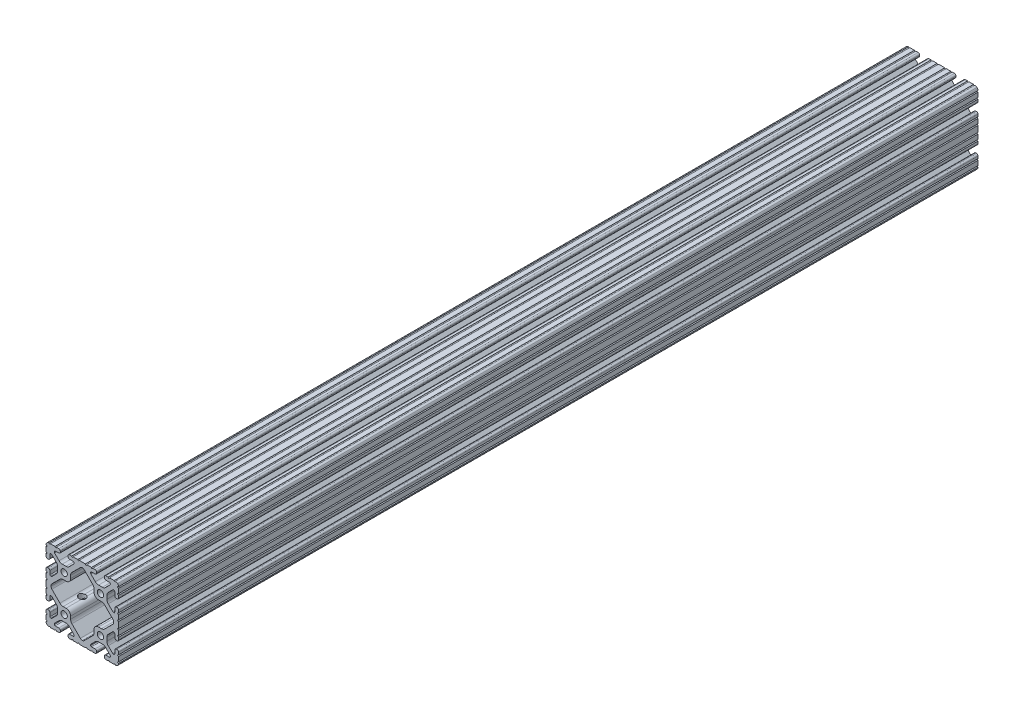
from build123d import *

# Parameters (mm, degrees)
SKETCH1_R      = 3.3274
EXTRUDE2_DEPTH = 901.7
SKETCH2_R      = 3.571875
EXTRUDE8_DEPTH = 76.2


with BuildPart() as part:
    # Sketch1 → Extrude2 (new body)
    with BuildSketch(Plane.XY):
        with BuildLine():
            Line((225.342686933, 144.720000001), (220.514725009, 144.720000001))
            ThreePointArc((220.514725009, 144.720000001), (219.752928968, 143.940370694), (218.991132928, 144.720000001))
            Line((218.991132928, 144.720000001), (216.708800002, 144.720000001))
            ThreePointArc((216.708800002, 144.720000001), (215.595248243, 144.25875176), (215.134000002, 143.145200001))
            Line((215.134000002, 143.145200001), (215.134000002, 142.230800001))
            ThreePointArc((215.134000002, 142.230800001), (215.595248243, 141.117248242), (216.708800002, 140.656000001))
            Line((216.708800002, 140.656000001), (220.468000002, 140.656000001))
            ThreePointArc((220.468000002, 140.656000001), (221.096617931, 140.395617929), (221.357000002, 139.767000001))
            Line((221.357000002, 139.767000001), (221.357000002, 139.113548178))
            ThreePointArc((221.357000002, 139.113548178), (221.289329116, 138.773343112), (221.096618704, 138.484931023))
            Line((221.096618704, 138.484931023), (216.4292875, 133.817588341))
            ThreePointArc((216.4292875, 133.817588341), (214.888340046, 132.787958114), (213.070667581, 132.4264))
            Line((213.070667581, 132.4264), (209.069332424, 132.4264))
            ThreePointArc((209.069332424, 132.4264), (207.251659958, 132.787958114), (205.710712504, 133.817588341))
            Line((205.710712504, 133.817588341), (201.019768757, 138.508543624))
            ThreePointArc((201.019768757, 138.508543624), (200.793324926, 138.893872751), (200.783000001, 139.340693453))
            Line((200.783000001, 139.340693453), (200.783000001, 139.767))
            ThreePointArc((200.783000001, 139.767), (201.043382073, 140.395617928), (201.672000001, 140.656))
            Line((201.672000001, 140.656), (205.431200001, 140.656))
            ThreePointArc((205.431200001, 140.656), (206.54475176, 141.117248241), (207.006000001, 142.2308))
            Line((207.006000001, 142.2308), (207.006000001, 143.1452))
            ThreePointArc((207.006000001, 143.1452), (206.54475176, 144.258751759), (205.431200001, 144.72))
            Line((205.431200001, 144.72), (203.042788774, 144.72))
            ThreePointArc((203.042788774, 144.72), (202.28084142, 143.940219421), (201.518894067, 144.72))
            Line((201.518894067, 144.72), (196.691221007, 144.72))
            ThreePointArc((196.691221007, 144.72), (195.929269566, 143.940215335), (195.167318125, 144.72))
            ThreePointArc((195.167318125, 144.72), (194.013713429, 144.463374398), (193.033876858, 143.802631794))
            ThreePointArc((193.033876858, 143.802631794), (192.282242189, 142.740195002), (192.020000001, 141.465457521))
            ThreePointArc((192.020000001, 141.465457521), (192.97852738, 140.729236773), (192.020000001, 139.993016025))
            Line((192.020000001, 139.993016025), (192.020000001, 135.165258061))
            ThreePointArc((192.020000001, 135.165258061), (193.002219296, 134.404542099), (192.020000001, 133.643826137))
            Line((192.020000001, 133.643826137), (192.020000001, 131.250195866))
            ThreePointArc((192.020000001, 131.250195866), (192.481248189, 130.136644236), (193.594799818, 129.675396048))
            Line((193.594799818, 129.675396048), (194.509200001, 129.675396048))
            ThreePointArc((194.509200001, 129.675396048), (195.62275176, 130.136644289), (196.084000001, 131.250196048))
            Line((196.084000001, 131.250196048), (196.084000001, 135.068))
            ThreePointArc((196.084000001, 135.068), (196.344382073, 135.696617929), (196.973000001, 135.957))
            Line((196.973000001, 135.957), (197.455712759, 135.957))
            ThreePointArc((197.455712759, 135.957), (197.795918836, 135.889328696), (198.084331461, 135.696617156))
            Line((198.084331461, 135.696617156), (202.922419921, 130.858516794))
            ThreePointArc((202.922419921, 130.858516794), (203.952044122, 129.317572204), (204.3136, 127.499905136))
            Line((204.3136, 127.499905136), (204.3136, 123.840094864))
            ThreePointArc((204.3136, 123.840094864), (203.952044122, 122.022427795), (202.92241992, 120.481483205))
            Line((202.92241992, 120.481483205), (198.171055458, 115.730107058))
            ThreePointArc((198.171055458, 115.730107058), (197.786582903, 115.473210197), (197.333066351, 115.383000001))
            Line((197.333066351, 115.383000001), (197.059724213, 115.383000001))
            ThreePointArc((197.059724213, 115.383000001), (196.369783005, 115.668783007), (196.084, 116.358724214))
            Line((196.084, 116.358724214), (196.084, 120.089803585))
            ThreePointArc((196.084, 120.089803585), (195.622751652, 121.203355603), (194.509199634, 121.664603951))
            Line((194.509199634, 121.664603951), (193.5948, 121.664603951))
            ThreePointArc((193.5948, 121.664603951), (192.481248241, 121.20335571), (192.02, 120.089803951))
            Line((192.02, 120.089803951), (192.02, 117.695039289))
            ThreePointArc((192.02, 117.695039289), (193.002999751, 116.933517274), (192.02, 116.171995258))
            Line((192.02, 116.171995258), (192.02, 111.343759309))
            ThreePointArc((192.02, 111.343759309), (193.002999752, 110.582237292), (192.020000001, 109.820715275))
            Line((192.020000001, 109.820715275), (192.020000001, 103.419284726))
            ThreePointArc((192.020000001, 103.419284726), (193.002999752, 102.65776271), (192.020000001, 101.896240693))
            Line((192.020000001, 101.896240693), (192.020000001, 97.068004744))
            ThreePointArc((192.020000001, 97.068004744), (193.002999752, 96.306482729), (192.020000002, 95.544960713))
            Line((192.020000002, 95.544960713), (192.020000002, 93.150196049))
            ThreePointArc((192.020000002, 93.150196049), (192.481248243, 92.03664429), (193.594800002, 91.575396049))
            Line((193.594800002, 91.575396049), (194.509199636, 91.575396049))
            ThreePointArc((194.509199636, 91.575396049), (195.622751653, 92.036644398), (196.084000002, 93.150196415))
            Line((196.084000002, 93.150196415), (196.084000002, 96.881275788))
            ThreePointArc((196.084000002, 96.881275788), (196.369783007, 97.571216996), (197.059724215, 97.857000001))
            Line((197.059724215, 97.857000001), (197.333066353, 97.857000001))
            ThreePointArc((197.333066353, 97.857000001), (197.786582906, 97.766789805), (198.171055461, 97.509892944))
            Line((198.171055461, 97.509892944), (202.922419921, 92.758516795))
            ThreePointArc((202.922419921, 92.758516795), (203.952044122, 91.217572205), (204.313600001, 89.399905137))
            Line((204.313600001, 89.399905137), (204.313600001, 85.740094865))
            ThreePointArc((204.313600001, 85.740094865), (203.952044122, 83.922427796), (202.92241992, 82.381483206))
            Line((202.92241992, 82.381483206), (198.084331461, 77.543382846))
            ThreePointArc((198.084331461, 77.543382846), (197.795918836, 77.350671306), (197.455712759, 77.283000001))
            Line((197.455712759, 77.283000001), (196.973000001, 77.283000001))
            ThreePointArc((196.973000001, 77.283000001), (196.344382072, 77.543382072), (196.084000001, 78.172000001))
            Line((196.084000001, 78.172000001), (196.084000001, 81.98980395))
            ThreePointArc((196.084000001, 81.98980395), (195.62275176, 83.103355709), (194.509200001, 83.56460395))
            Line((194.509200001, 83.56460395), (193.594799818, 83.56460395))
            ThreePointArc((193.594799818, 83.56460395), (192.481248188, 83.103355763), (192.020000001, 81.989804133))
            Line((192.020000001, 81.989804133), (192.020000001, 79.596173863))
            ThreePointArc((192.020000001, 79.596173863), (193.002219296, 78.835457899), (192.020000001, 78.074741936))
            Line((192.020000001, 78.074741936), (192.020000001, 73.246983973))
            ThreePointArc((192.020000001, 73.246983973), (192.97852738, 72.510763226), (192.020000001, 71.774542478))
            ThreePointArc((192.020000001, 71.774542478), (192.282242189, 70.499804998), (193.033876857, 69.437368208))
            ThreePointArc((193.033876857, 69.437368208), (194.013713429, 68.776625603), (195.167318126, 68.520000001))
            ThreePointArc((195.167318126, 68.520000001), (195.929269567, 69.299784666), (196.691221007, 68.520000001))
            Line((196.691221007, 68.520000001), (201.518894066, 68.520000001))
            ThreePointArc((201.518894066, 68.520000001), (202.280841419, 69.29978058), (203.042788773, 68.520000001))
            Line((203.042788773, 68.520000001), (205.431200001, 68.520000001))
            ThreePointArc((205.431200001, 68.520000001), (206.54475176, 68.981248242), (207.006000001, 70.094800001))
            Line((207.006000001, 70.094800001), (207.006000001, 71.009200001))
            ThreePointArc((207.006000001, 71.009200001), (206.54475176, 72.12275176), (205.431200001, 72.584000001))
            Line((205.431200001, 72.584000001), (201.672000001, 72.584000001))
            ThreePointArc((201.672000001, 72.584000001), (201.043382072, 72.844382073), (200.783000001, 73.473000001))
            Line((200.783000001, 73.473000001), (200.783000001, 73.899306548))
            ThreePointArc((200.783000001, 73.899306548), (200.793324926, 74.346127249), (201.019768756, 74.731456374))
            Line((201.019768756, 74.731456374), (205.710712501, 79.422411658))
            ThreePointArc((205.710712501, 79.422411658), (207.251659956, 80.452041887), (209.069332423, 80.813600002))
            Line((209.069332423, 80.813600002), (213.07066758, 80.813600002))
            ThreePointArc((213.07066758, 80.813600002), (214.888340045, 80.452041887), (216.4292875, 79.42241166))
            Line((216.4292875, 79.42241166), (221.096618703, 74.755068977))
            ThreePointArc((221.096618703, 74.755068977), (221.289329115, 74.466656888), (221.357000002, 74.126451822))
            Line((221.357000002, 74.126451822), (221.357000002, 73.473000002))
            ThreePointArc((221.357000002, 73.473000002), (221.09661793, 72.844382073), (220.468000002, 72.584000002))
            Line((220.468000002, 72.584000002), (216.708800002, 72.584000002))
            ThreePointArc((216.708800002, 72.584000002), (215.595248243, 72.122751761), (215.134000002, 71.009200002))
            Line((215.134000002, 71.009200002), (215.134000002, 70.094800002))
            ThreePointArc((215.134000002, 70.094800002), (215.595248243, 68.981248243), (216.708800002, 68.520000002))
            Line((216.708800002, 68.520000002), (218.991132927, 68.520000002))
            ThreePointArc((218.991132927, 68.520000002), (219.752928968, 69.299629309), (220.514725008, 68.520000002))
            Line((220.514725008, 68.520000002), (225.342686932, 68.520000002))
            ThreePointArc((225.342686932, 68.520000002), (226.104482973, 69.299629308), (226.866279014, 68.520000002))
            Line((226.866279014, 68.520000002), (233.37372099, 68.520000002))
            ThreePointArc((233.37372099, 68.520000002), (234.13551703, 69.299629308), (234.897313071, 68.520000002))
            Line((234.897313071, 68.520000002), (239.725274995, 68.520000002))
            ThreePointArc((239.725274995, 68.520000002), (240.487071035, 69.299629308), (241.248867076, 68.520000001))
            Line((241.248867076, 68.520000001), (243.531200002, 68.520000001))
            ThreePointArc((243.531200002, 68.520000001), (244.644751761, 68.981248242), (245.106000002, 70.094800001))
            Line((245.106000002, 70.094800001), (245.106000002, 71.009200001))
            ThreePointArc((245.106000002, 71.009200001), (244.644751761, 72.12275176), (243.531200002, 72.584000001))
            Line((243.531200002, 72.584000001), (239.772000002, 72.584000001))
            ThreePointArc((239.772000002, 72.584000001), (239.143382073, 72.844382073), (238.883000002, 73.473000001))
            Line((238.883000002, 73.473000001), (238.883000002, 74.126451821))
            ThreePointArc((238.883000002, 74.126451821), (238.950670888, 74.466656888), (239.1433813, 74.755068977))
            Line((239.1433813, 74.755068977), (243.810712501, 79.422411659))
            ThreePointArc((243.810712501, 79.422411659), (245.351659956, 80.452041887), (247.169332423, 80.813600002))
            Line((247.169332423, 80.813600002), (251.17066758, 80.813600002))
            ThreePointArc((251.17066758, 80.813600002), (252.988340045, 80.452041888), (254.5292875, 79.422411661))
            Line((254.5292875, 79.422411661), (259.220231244, 74.731456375))
            ThreePointArc((259.220231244, 74.731456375), (259.446675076, 74.346127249), (259.457000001, 73.899306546))
            Line((259.457000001, 73.899306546), (259.457000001, 73.473000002))
            ThreePointArc((259.457000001, 73.473000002), (259.196617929, 72.844382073), (258.568000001, 72.584000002))
            Line((258.568000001, 72.584000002), (254.808800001, 72.584000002))
            ThreePointArc((254.808800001, 72.584000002), (253.695248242, 72.122751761), (253.234000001, 71.009200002))
            Line((253.234000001, 71.009200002), (253.234000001, 70.094800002))
            ThreePointArc((253.234000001, 70.094800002), (253.695248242, 68.981248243), (254.808800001, 68.520000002))
            Line((254.808800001, 68.520000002), (257.197211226, 68.520000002))
            ThreePointArc((257.197211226, 68.520000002), (257.959158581, 69.299780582), (258.721105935, 68.520000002))
            Line((258.721105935, 68.520000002), (263.548778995, 68.520000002))
            ThreePointArc((263.548778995, 68.520000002), (264.310730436, 69.299784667), (265.072681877, 68.520000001))
            ThreePointArc((265.072681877, 68.520000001), (266.226286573, 68.776625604), (267.206123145, 69.437368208))
            ThreePointArc((267.206123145, 69.437368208), (267.957757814, 70.499804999), (268.220000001, 71.77454248))
            ThreePointArc((268.220000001, 71.77454248), (267.261472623, 72.510763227), (268.220000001, 73.246983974))
            Line((268.220000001, 73.246983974), (268.220000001, 78.074741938))
            ThreePointArc((268.220000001, 78.074741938), (267.237780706, 78.8354579), (268.22, 79.596173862))
            Line((268.22, 79.596173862), (268.22, 81.989804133))
            ThreePointArc((268.22, 81.989804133), (267.758751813, 83.103355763), (266.645200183, 83.564603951))
            Line((266.645200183, 83.564603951), (265.7308, 83.564603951))
            ThreePointArc((265.7308, 83.564603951), (264.617248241, 83.10335571), (264.156, 81.989803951))
            Line((264.156, 81.989803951), (264.156, 78.172000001))
            ThreePointArc((264.156, 78.172000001), (263.895617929, 77.543382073), (263.267, 77.283000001))
            Line((263.267, 77.283000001), (262.784287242, 77.283000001))
            ThreePointArc((262.784287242, 77.283000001), (262.444081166, 77.350671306), (262.15566854, 77.543382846))
            Line((262.15566854, 77.543382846), (257.31758008, 82.381483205))
            ThreePointArc((257.31758008, 82.381483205), (256.287955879, 83.922427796), (255.9264, 85.740094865))
            Line((255.9264, 85.740094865), (255.9264, 89.399905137))
            ThreePointArc((255.9264, 89.399905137), (256.287955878, 91.217572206), (257.31758008, 92.758516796))
            Line((257.31758008, 92.758516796), (262.06894454, 97.509892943))
            ThreePointArc((262.06894454, 97.509892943), (262.453417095, 97.766789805), (262.906933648, 97.857000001))
            Line((262.906933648, 97.857000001), (263.180275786, 97.857000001))
            ThreePointArc((263.180275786, 97.857000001), (263.870216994, 97.571216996), (264.156, 96.881275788))
            Line((264.156, 96.881275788), (264.156, 93.150196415))
            ThreePointArc((264.156, 93.150196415), (264.617248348, 92.036644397), (265.730800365, 91.575396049))
            Line((265.730800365, 91.575396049), (266.6452, 91.575396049))
            ThreePointArc((266.6452, 91.575396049), (267.758751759, 92.03664429), (268.22, 93.150196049))
            Line((268.22, 93.150196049), (268.22, 95.544960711))
            ThreePointArc((268.22, 95.544960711), (267.237000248, 96.306482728), (268.219999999, 97.068004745))
            Line((268.219999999, 97.068004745), (268.219999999, 101.896240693))
            ThreePointArc((268.219999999, 101.896240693), (267.237000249, 102.657762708), (268.219999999, 103.419284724))
            Line((268.219999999, 103.419284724), (268.219999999, 109.820715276))
            ThreePointArc((268.219999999, 109.820715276), (267.237000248, 110.582237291), (268.219999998, 111.343759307))
            Line((268.219999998, 111.343759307), (268.219999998, 116.171995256))
            ThreePointArc((268.219999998, 116.171995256), (267.237000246, 116.933517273), (268.219999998, 117.695039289))
            Line((268.219999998, 117.695039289), (268.219999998, 120.08980395))
            ThreePointArc((268.219999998, 120.08980395), (267.758751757, 121.20335571), (266.645199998, 121.66460395))
            Line((266.645199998, 121.66460395), (265.730800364, 121.66460395))
            ThreePointArc((265.730800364, 121.66460395), (264.617248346, 121.203355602), (264.155999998, 120.089803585))
            Line((264.155999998, 120.089803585), (264.155999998, 116.358724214))
            ThreePointArc((264.155999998, 116.358724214), (263.870216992, 115.668783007), (263.180275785, 115.383000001))
            Line((263.180275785, 115.383000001), (262.906933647, 115.383000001))
            ThreePointArc((262.906933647, 115.383000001), (262.453417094, 115.473210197), (262.068944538, 115.730107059))
            Line((262.068944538, 115.730107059), (257.317580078, 120.481483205))
            ThreePointArc((257.317580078, 120.481483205), (256.287955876, 122.022427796), (255.926399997, 123.840094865))
            Line((255.926399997, 123.840094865), (255.926399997, 127.499905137))
            ThreePointArc((255.926399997, 127.499905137), (256.287955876, 129.317572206), (257.317580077, 130.858516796))
            Line((257.317580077, 130.858516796), (262.155668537, 135.696617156))
            ThreePointArc((262.155668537, 135.696617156), (262.444081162, 135.889328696), (262.784287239, 135.957000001))
            Line((262.784287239, 135.957000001), (263.266999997, 135.957000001))
            ThreePointArc((263.266999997, 135.957000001), (263.895617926, 135.69661793), (264.155999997, 135.068000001))
            Line((264.155999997, 135.068000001), (264.155999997, 131.250196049))
            ThreePointArc((264.155999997, 131.250196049), (264.617248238, 130.13664429), (265.730799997, 129.675396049))
            Line((265.730799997, 129.675396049), (266.64520018, 129.675396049))
            ThreePointArc((266.64520018, 129.675396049), (267.75875181, 130.136644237), (268.219999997, 131.250195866))
            Line((268.219999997, 131.250195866), (268.219999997, 133.643826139))
            ThreePointArc((268.219999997, 133.643826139), (267.237780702, 134.404542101), (268.219999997, 135.165258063))
            Line((268.219999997, 135.165258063), (268.219999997, 139.993016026))
            ThreePointArc((268.219999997, 139.993016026), (267.261472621, 140.729236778), (268.220000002, 141.465457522))
            ThreePointArc((268.220000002, 141.465457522), (267.957757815, 142.740195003), (267.206123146, 143.802631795))
            ThreePointArc((267.206123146, 143.802631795), (266.226286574, 144.463374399), (265.072681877, 144.720000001))
            ThreePointArc((265.072681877, 144.720000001), (264.310730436, 143.940215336), (263.548778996, 144.720000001))
            Line((263.548778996, 144.720000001), (258.721105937, 144.720000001))
            ThreePointArc((258.721105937, 144.720000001), (257.959158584, 143.940219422), (257.19721123, 144.720000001))
            Line((257.19721123, 144.720000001), (254.808800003, 144.720000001))
            ThreePointArc((254.808800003, 144.720000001), (253.695248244, 144.25875176), (253.234000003, 143.145200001))
            Line((253.234000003, 143.145200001), (253.234000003, 142.230800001))
            ThreePointArc((253.234000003, 142.230800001), (253.695248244, 141.117248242), (254.808800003, 140.656000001))
            Line((254.808800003, 140.656000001), (258.568000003, 140.656000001))
            ThreePointArc((258.568000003, 140.656000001), (259.196617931, 140.395617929), (259.457000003, 139.767000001))
            Line((259.457000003, 139.767000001), (259.457000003, 139.340693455))
            ThreePointArc((259.457000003, 139.340693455), (259.446675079, 138.893872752), (259.220231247, 138.508543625))
            Line((259.220231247, 138.508543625), (254.5292875, 133.817588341))
            ThreePointArc((254.5292875, 133.817588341), (252.988340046, 132.787958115), (251.170667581, 132.426400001))
            Line((251.170667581, 132.426400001), (247.169332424, 132.426400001))
            ThreePointArc((247.169332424, 132.426400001), (245.351659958, 132.787958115), (243.810712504, 133.817588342))
            Line((243.810712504, 133.817588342), (239.1433813, 138.484931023))
            ThreePointArc((239.1433813, 138.484931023), (238.950670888, 138.773343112), (238.883000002, 139.113548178))
            Line((238.883000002, 139.113548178), (238.883000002, 139.767))
            ThreePointArc((238.883000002, 139.767), (239.143382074, 140.395617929), (239.772000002, 140.656))
            Line((239.772000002, 140.656), (243.531200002, 140.656))
            ThreePointArc((243.531200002, 140.656), (244.644751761, 141.117248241), (245.106000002, 142.2308))
            Line((245.106000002, 142.2308), (245.106000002, 143.1452))
            ThreePointArc((245.106000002, 143.1452), (244.644751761, 144.258751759), (243.531200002, 144.72))
            Line((243.531200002, 144.72), (241.248867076, 144.72))
            ThreePointArc((241.248867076, 144.72), (240.487071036, 143.940370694), (239.725274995, 144.72))
            Line((239.725274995, 144.72), (234.897313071, 144.72))
            ThreePointArc((234.897313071, 144.72), (234.135517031, 143.940370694), (233.37372099, 144.720000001))
            Line((233.37372099, 144.720000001), (226.866279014, 144.720000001))
            ThreePointArc((226.866279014, 144.720000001), (226.104482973, 143.940370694), (225.342686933, 144.720000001))
        make_face()
        with Locations(Location((211.07, 125.670000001, 0), (0, 0, 180))):
            Circle(SKETCH1_R, mode=Mode.SUBTRACT)
        with Locations(Location((211.07, 87.570000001, 0), (0, 0, 180))):
            Circle(SKETCH1_R, mode=Mode.SUBTRACT)
        with Locations(Location((249.17, 87.570000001, 0), (0, 0, 180))):
            Circle(SKETCH1_R, mode=Mode.SUBTRACT)
        with Locations(Location((249.17, 125.670000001, 0), (0, 0, 180))):
            Circle(SKETCH1_R, mode=Mode.SUBTRACT)
        with BuildLine():
            Line((242.413599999, 86.674042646), (242.413599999, 89.576599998))
            ThreePointArc((242.413599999, 89.576599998), (243.80478421, 92.935215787), (247.163399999, 94.326399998))
            Line((247.163399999, 94.326399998), (250.23672209, 94.326399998))
            ThreePointArc((250.23672209, 94.326399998), (252.054394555, 94.687958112), (253.59534201, 95.717588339))
            Line((253.59534201, 95.717588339), (262.022125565, 104.14439262))
            ThreePointArc((262.022125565, 104.14439262), (262.727298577, 105.284740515), (262.848725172, 106.619999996))
            ThreePointArc((262.848725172, 106.619999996), (262.727298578, 107.95525948), (262.022125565, 109.095607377))
            Line((262.022125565, 109.095607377), (253.595342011, 117.522411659))
            ThreePointArc((253.595342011, 117.522411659), (252.054394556, 118.552041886), (250.23672209, 118.9136))
            Line((250.23672209, 118.9136), (247.1634, 118.9136))
            ThreePointArc((247.1634, 118.9136), (243.804784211, 120.304784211), (242.4136, 123.6634))
            Line((242.4136, 123.6634), (242.4136, 126.56595735))
            ThreePointArc((242.4136, 126.56595735), (242.052044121, 128.383624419), (241.02241992, 129.924569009))
            Line((241.02241992, 129.924569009), (232.171515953, 138.775494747))
            ThreePointArc((232.171515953, 138.775494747), (231.230313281, 139.406013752), (230.119999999, 139.631005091))
            ThreePointArc((230.119999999, 139.631005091), (229.00968672, 139.406013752), (228.068484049, 138.775494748))
            Line((228.068484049, 138.775494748), (219.21758008, 129.92456901))
            ThreePointArc((219.21758008, 129.92456901), (218.187955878, 128.38362442), (217.826399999, 126.565957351))
            Line((217.826399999, 126.565957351), (217.826399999, 123.663400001))
            ThreePointArc((217.826399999, 123.663400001), (216.435215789, 120.304784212), (213.076599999, 118.913600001))
            Line((213.076599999, 118.913600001), (210.003277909, 118.913600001))
            ThreePointArc((210.003277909, 118.913600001), (208.185605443, 118.552041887), (206.644657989, 117.52241166))
            Line((206.644657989, 117.52241166), (198.217874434, 109.095607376))
            ThreePointArc((198.217874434, 109.095607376), (197.512701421, 107.955259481), (197.391274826, 106.62))
            ThreePointArc((197.391274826, 106.62), (197.512701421, 105.284740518), (198.217874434, 104.144392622))
            Line((198.217874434, 104.144392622), (206.644657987, 95.717588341))
            ThreePointArc((206.644657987, 95.717588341), (208.185605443, 94.687958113), (210.003277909, 94.326399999))
            Line((210.003277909, 94.326399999), (213.0766, 94.326399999))
            ThreePointArc((213.0766, 94.326399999), (216.435215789, 92.935215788), (217.8264, 89.576599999))
            Line((217.8264, 89.576599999), (217.8264, 86.674042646))
            ThreePointArc((217.8264, 86.674042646), (218.187955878, 84.856375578), (219.21758008, 83.315430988))
            Line((219.21758008, 83.315430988), (228.068484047, 74.464505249))
            ThreePointArc((228.068484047, 74.464505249), (229.009686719, 73.833986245), (230.12, 73.608994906))
            ThreePointArc((230.12, 73.608994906), (231.23031328, 73.833986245), (232.171515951, 74.464505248))
            Line((232.171515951, 74.464505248), (241.022419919, 83.315430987))
            ThreePointArc((241.022419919, 83.315430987), (242.052044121, 84.856375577), (242.413599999, 86.674042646))
        make_face(mode=Mode.SUBTRACT)
    extrude(amount=EXTRUDE2_DEPTH)

    # Sketch2 → Extrude8 (cut)
    with BuildSketch(Plane(origin=(123.499999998, 144.720000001, 0), x_dir=(0, 0, -1), z_dir=(0, -1, 0))):
        with Locations(Location((-882.65, 125.670000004, 0), (0, 0, 162.623771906))):
            Circle(SKETCH2_R)
        with Locations(Location((-82.55, 125.670000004, 0), (0, 0, 162.623771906))):
            Circle(SKETCH2_R)
        with Locations(Location((-882.65, 87.570000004, 0), (0, 0, 197.376228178))):
            Circle(SKETCH2_R)
        with Locations(Location((-82.55, 87.570000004, 0), (0, 0, 197.376228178))):
            Circle(SKETCH2_R)
    extrude(amount=EXTRUDE8_DEPTH, mode=Mode.SUBTRACT)


solid = part.part
